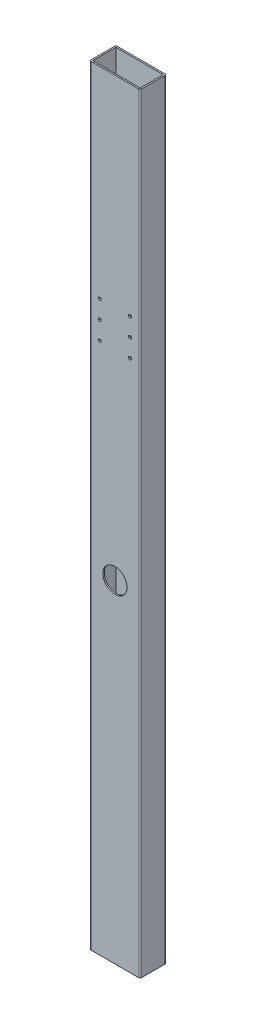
from build123d import *

# Parameters (mm, degrees)
SKETCH1_W           = 49.657
SKETCH1_H           = 24.257
EXTRUDE_THIN1_DEPTH = 589.28
SKETCH2_R           = 12.7
CUT_EXTRUDE1_DEPTH  = 591.509303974
SKETCH4_W           = 49.657
SKETCH4_H           = 24.257
BOSS_EXTRUDE1_DEPTH = 217.17
SKETCH3_R           = 1.5875
CUT_EXTRUDE2_DEPTH  = 808.34869925


with BuildPart() as part:
    # Sketch1 → Extrude-Thin1 (new body)
    with BuildSketch(Plane(origin=(0, 0, 0), x_dir=(1, 0, 0), z_dir=(0, 1, 0))):
        with BuildLine():
            Line((-26.416, 12.1285), (-26.416, -12.1285))
            ThreePointArc((-26.416, -12.1285), (-25.951032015, -13.251032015), (-24.8285, -13.716))
            Line((-24.8285, -13.716), (24.8285, -13.716))
            ThreePointArc((24.8285, -13.716), (25.951032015, -13.251032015), (26.416, -12.1285))
            Line((26.416, -12.1285), (26.416, 12.1285))
            ThreePointArc((26.416, 12.1285), (25.951032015, 13.251032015), (24.8285, 13.716))
            Line((24.8285, 13.716), (-24.8285, 13.716))
            ThreePointArc((-24.8285, 13.716), (-25.951032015, 13.251032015), (-26.416, 12.1285))
        make_face()
        Rectangle(SKETCH1_W, SKETCH1_H, mode=Mode.SUBTRACT)
    extrude(amount=EXTRUDE_THIN1_DEPTH)

    # Sketch2 → Cut-Extrude1 (cut, through all)
    with BuildSketch(Plane.XY.offset(13.716)):
        with Locations((0, 347.98)):
            Circle(SKETCH2_R)
    extrude(amount=-CUT_EXTRUDE1_DEPTH, mode=Mode.SUBTRACT)

    # Sketch4 → Boss-Extrude1 (add)
    with BuildSketch(Plane(origin=(0, 589.28, 0), x_dir=(1, 0, 0), z_dir=(0, 1, 0))):
        with BuildLine():
            Line((-24.8285, -13.716), (24.8285, -13.716))
            ThreePointArc((24.8285, -13.716), (25.951032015, -13.251032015), (26.416, -12.1285))
            Line((26.416, -12.1285), (26.416, 12.1285))
            ThreePointArc((26.416, 12.1285), (25.951032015, 13.251032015), (24.8285, 13.716))
            Line((24.8285, 13.716), (-24.8285, 13.716))
            ThreePointArc((-24.8285, 13.716), (-25.951032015, 13.251032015), (-26.416, 12.1285))
            Line((-26.416, 12.1285), (-26.416, -12.1285))
            ThreePointArc((-26.416, -12.1285), (-25.951032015, -13.251032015), (-24.8285, -13.716))
        make_face()
        Rectangle(SKETCH4_W, SKETCH4_H, mode=Mode.SUBTRACT)
    extrude(amount=BOSS_EXTRUDE1_DEPTH)

    # Sketch3 → Cut-Extrude2 (cut, through all)
    with BuildSketch(Plane.XY.offset(13.716)):
        with Locations((15.875, 576.58)):
            Circle(SKETCH3_R)
        with Locations((15.875, 557.53)):
            Circle(SKETCH3_R)
        with Locations((-15.875, 576.58)):
            Circle(SKETCH3_R)
        with Locations((-15.875, 557.53)):
            Circle(SKETCH3_R)
        with Locations((-15.875, 595.63)):
            Circle(SKETCH3_R)
        with Locations((15.875, 595.63)):
            Circle(SKETCH3_R)
    extrude(amount=-CUT_EXTRUDE2_DEPTH, mode=Mode.SUBTRACT)


solid = part.part
